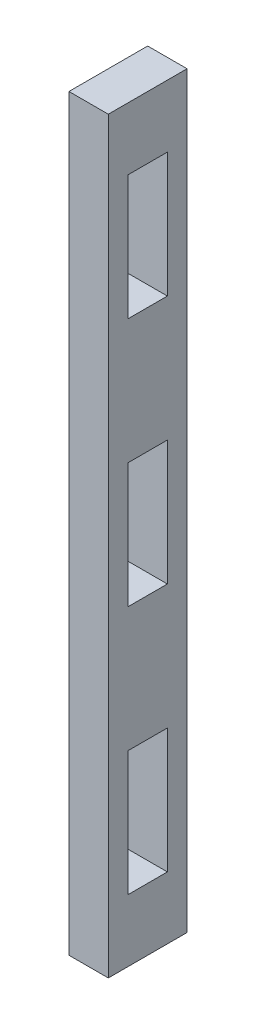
from build123d import *

# Parameters (mm, degrees)
SKETCH1_W           = 6.35
SKETCH1_H           = 60.325
BOSS_EXTRUDE1_DEPTH = 3.175
SKETCH2_W           = 3.175
SKETCH2_H           = 10.054166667
CUT_EXTRUDE1_DEPTH  = 61.741326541
LPATTERN1_COUNT     = 3
LPATTERN1_PITCH     = 20.108333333


with BuildPart() as part:
    # Sketch1 → Boss-Extrude1 (new body)
    with BuildSketch(Plane(origin=(0, 0, 0), x_dir=(0, 0, -1), z_dir=(1, 0, 0))):
        with Locations((3.175, 30.1625)):
            Rectangle(SKETCH1_W, SKETCH1_H)
    extrude(amount=BOSS_EXTRUDE1_DEPTH)

    # Sketch2 → Cut-Extrude1 (cut, through all)
    with BuildSketch(Plane(origin=(3.175, 0, 0), x_dir=(0, 0, -1), z_dir=(1, 0, 0))):
        with Locations((3.175, 10.054166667)):
            Rectangle(SKETCH2_W, SKETCH2_H)
        with Locations((3.175, 76.094166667)):
            Rectangle(SKETCH2_W, SKETCH2_H)
    cut_extrude1 = extrude(amount=-CUT_EXTRUDE1_DEPTH, mode=Mode.SUBTRACT)

    # LPattern1: Cut-Extrude1 ×3
    with Locations(*[(0, i * LPATTERN1_PITCH, 0) for i in range(1, LPATTERN1_COUNT)]):
        add(cut_extrude1, mode=Mode.SUBTRACT)


solid = part.part
